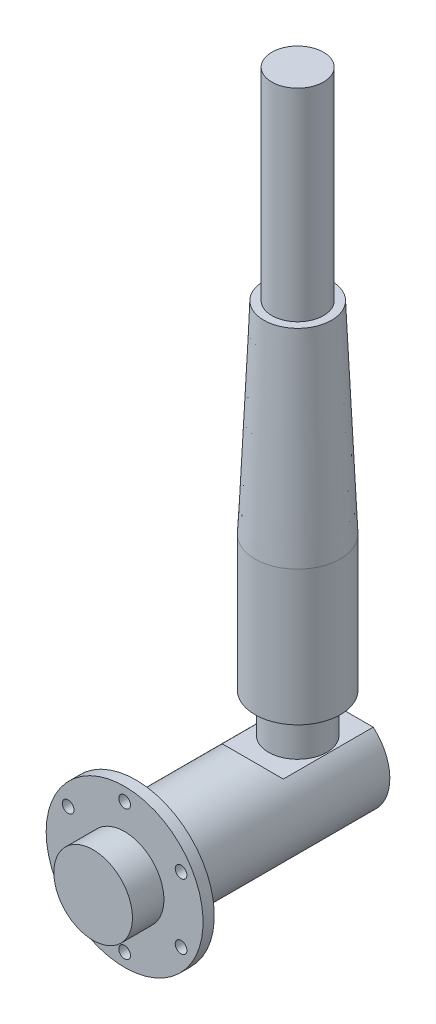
ISO-10303-21;
HEADER;
FILE_DESCRIPTION(('STEP AP214'),'2;1');
FILE_NAME('part.step','',(''),(''),'','','');
FILE_SCHEMA(('AUTOMOTIVE_DESIGN { 1 0 10303 214 1 1 1 1 }'));
ENDSEC;
DATA;
#1=APPLICATION_CONTEXT('core data for automotive mechanical design processes');
#2=APPLICATION_PROTOCOL_DEFINITION('international standard','automotive_design',2000,#1);
#3=PRODUCT_CONTEXT('',#1,'mechanical');
#4=PRODUCT('Part','Part','',(#3));
#5=PRODUCT_RELATED_PRODUCT_CATEGORY('part','',(#4));
#6=PRODUCT_DEFINITION_FORMATION('','',#4);
#7=PRODUCT_DEFINITION_CONTEXT('part definition',#1,'design');
#8=PRODUCT_DEFINITION('design','',#6,#7);
#9=PRODUCT_DEFINITION_SHAPE('','',#8);
#10=(LENGTH_UNIT() NAMED_UNIT(*) SI_UNIT(.MILLI.,.METRE.));
#11=(NAMED_UNIT(*) PLANE_ANGLE_UNIT() SI_UNIT($,.RADIAN.));
#12=(NAMED_UNIT(*) SI_UNIT($,.STERADIAN.) SOLID_ANGLE_UNIT());
#13=UNCERTAINTY_MEASURE_WITH_UNIT(LENGTH_MEASURE(1.E-05),#10,'distance_accuracy_value','');
#14=(GEOMETRIC_REPRESENTATION_CONTEXT(3) GLOBAL_UNCERTAINTY_ASSIGNED_CONTEXT((#13)) GLOBAL_UNIT_ASSIGNED_CONTEXT((#10,
#11,#12)) REPRESENTATION_CONTEXT('',''));
#15=CARTESIAN_POINT('',(0.,0.,0.));
#16=DIRECTION('',(0.,0.,1.));
#17=DIRECTION('',(1.,0.,0.));
#18=AXIS2_PLACEMENT_3D('',#15,#16,#17);
#19=CARTESIAN_POINT('',(0.,233.045,-97.79));
#20=DIRECTION('',(0.,1.,0.));
#21=DIRECTION('',(0.,0.,1.));
#22=AXIS2_PLACEMENT_3D('',#19,#20,#21);
#23=PLANE('',#22);
#24=CARTESIAN_POINT('',(0.,233.045,-97.79));
#25=DIRECTION('',(0.,1.,0.));
#26=DIRECTION('',(0.,0.,1.));
#27=AXIS2_PLACEMENT_3D('',#24,#25,#26);
#28=CIRCLE('',#27,19.13955422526);
#29=CARTESIAN_POINT('',(0.,233.045,-78.65044577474));
#30=VERTEX_POINT('',#29);
#31=EDGE_CURVE('E457',#30,#30,#28,.T.);
#32=ORIENTED_EDGE('',*,*,#31,.T.);
#33=EDGE_LOOP('',(#32));
#34=FACE_BOUND('',#33,.T.);
#35=CARTESIAN_POINT('',(0.,233.045,-97.79));
#36=DIRECTION('',(0.,1.,0.));
#37=DIRECTION('',(0.,0.,1.));
#38=AXIS2_PLACEMENT_3D('',#35,#36,#37);
#39=CIRCLE('',#38,14.605);
#40=CARTESIAN_POINT('',(0.,233.045,-83.185));
#41=VERTEX_POINT('',#40);
#42=EDGE_CURVE('E463',#41,#41,#39,.T.);
#43=ORIENTED_EDGE('',*,*,#42,.F.);
#44=EDGE_LOOP('',(#43));
#45=FACE_BOUND('',#44,.T.);
#46=ADVANCED_FACE('F383',(#34,#45),#23,.T.);
#47=CARTESIAN_POINT('',(0.,0.,-123.19));
#48=DIRECTION('',(0.,0.,-1.));
#49=DIRECTION('',(-1.,0.,0.));
#50=AXIS2_PLACEMENT_3D('',#47,#48,#49);
#51=PLANE('',#50);
#52=DIRECTION('',(1.,0.,0.));
#53=VECTOR('',#52,1.);
#54=CARTESIAN_POINT('',(-44.323,20.32,-123.19));
#55=LINE('',#54,#53);
#56=CARTESIAN_POINT('',(-17.273867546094,20.32,-123.19));
#57=VERTEX_POINT('',#56);
#58=CARTESIAN_POINT('',(17.273867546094,20.32,-123.19));
#59=VERTEX_POINT('',#58);
#60=EDGE_CURVE('E415',#57,#59,#55,.T.);
#61=ORIENTED_EDGE('',*,*,#60,.T.);
#62=CARTESIAN_POINT('',(0.,0.,-123.19));
#63=DIRECTION('',(0.,0.,-1.));
#64=DIRECTION('',(-1.,0.,0.));
#65=AXIS2_PLACEMENT_3D('',#62,#63,#64);
#66=CIRCLE('',#65,26.67);
#67=EDGE_CURVE('E412',#59,#57,#66,.T.);
#68=ORIENTED_EDGE('',*,*,#67,.T.);
#69=EDGE_LOOP('',(#61,#68));
#70=FACE_BOUND('',#69,.T.);
#71=ADVANCED_FACE('F385',(#70),#51,.T.);
#72=CARTESIAN_POINT('',(0.,0.,-163.063601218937));
#73=DIRECTION('',(0.,0.,-1.));
#74=DIRECTION('',(-1.,0.,0.));
#75=AXIS2_PLACEMENT_3D('',#72,#73,#74);
#76=CYLINDRICAL_SURFACE('',#75,26.67);
#77=DIRECTION('',(0.,0.,-1.));
#78=VECTOR('',#77,1.);
#79=CARTESIAN_POINT('',(-17.273867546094,20.32,-163.063601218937));
#80=LINE('',#79,#78);
#81=CARTESIAN_POINT('',(-17.273867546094,20.32,-72.39));
#82=VERTEX_POINT('',#81);
#83=EDGE_CURVE('E11',#57,#82,#80,.F.);
#84=ORIENTED_EDGE('',*,*,#83,.F.);
#85=ORIENTED_EDGE('',*,*,#67,.F.);
#86=DIRECTION('',(0.,0.,-1.));
#87=VECTOR('',#86,1.);
#88=CARTESIAN_POINT('',(17.273867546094,20.32,-163.063601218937));
#89=LINE('',#88,#87);
#90=CARTESIAN_POINT('',(17.273867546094,20.32,-72.39));
#91=VERTEX_POINT('',#90);
#92=EDGE_CURVE('E391',#91,#59,#89,.T.);
#93=ORIENTED_EDGE('',*,*,#92,.F.);
#94=CARTESIAN_POINT('',(0.,0.,-92.7100000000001));
#95=DIRECTION('',(0.,-0.707106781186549,0.707106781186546));
#96=DIRECTION('',(0.,-0.707106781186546,-0.707106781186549));
#97=AXIS2_PLACEMENT_3D('',#94,#95,#96);
#98=ELLIPSE('',#97,37.7170757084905,26.67);
#99=EDGE_CURVE('E408',#82,#91,#98,.F.);
#100=ORIENTED_EDGE('',*,*,#99,.F.);
#101=EDGE_LOOP('',(#84,#85,#93,#100));
#102=FACE_BOUND('',#101,.T.);
#103=CARTESIAN_POINT('',(0.,0.,-6.34999999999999));
#104=DIRECTION('',(0.,0.,-1.));
#105=DIRECTION('',(-1.,0.,0.));
#106=AXIS2_PLACEMENT_3D('',#103,#104,#105);
#107=CIRCLE('',#106,26.67);
#108=CARTESIAN_POINT('',(-26.67,0.,-6.34999999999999));
#109=VERTEX_POINT('',#108);
#110=EDGE_CURVE('E424',#109,#109,#107,.T.);
#111=ORIENTED_EDGE('',*,*,#110,.T.);
#112=EDGE_LOOP('',(#111));
#113=FACE_BOUND('',#112,.T.);
#114=ADVANCED_FACE('F419',(#102,#113),#76,.T.);
#115=CARTESIAN_POINT('',(-44.323,0.,-6.35));
#116=DIRECTION('',(0.,0.,-1.));
#117=DIRECTION('',(-1.,0.,0.));
#118=AXIS2_PLACEMENT_3D('',#115,#116,#117);
#119=PLANE('',#118);
#120=CARTESIAN_POINT('',(31.8957156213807,18.4150000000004,-6.34999999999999));
#121=DIRECTION('',(0.,0.,-1.));
#122=DIRECTION('',(-0.50000000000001,0.866025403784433,0.));
#123=AXIS2_PLACEMENT_3D('',#120,#121,#122);
#124=CIRCLE('',#123,3.302);
#125=CARTESIAN_POINT('',(30.2447156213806,21.2746158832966,-6.34999999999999));
#126=VERTEX_POINT('',#125);
#127=EDGE_CURVE('E499',#126,#126,#124,.F.);
#128=ORIENTED_EDGE('',*,*,#127,.T.);
#129=EDGE_LOOP('',(#128));
#130=FACE_BOUND('',#129,.T.);
#131=CARTESIAN_POINT('',(31.895715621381,-18.4149999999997,-6.34999999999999));
#132=DIRECTION('',(0.,0.,-1.));
#133=DIRECTION('',(0.499999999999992,0.866025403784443,0.));
#134=AXIS2_PLACEMENT_3D('',#131,#132,#133);
#135=CIRCLE('',#134,3.302);
#136=CARTESIAN_POINT('',(33.546715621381,-15.5553841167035,-6.34999999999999));
#137=VERTEX_POINT('',#136);
#138=EDGE_CURVE('E493',#137,#137,#135,.F.);
#139=ORIENTED_EDGE('',*,*,#138,.T.);
#140=EDGE_LOOP('',(#139));
#141=FACE_BOUND('',#140,.T.);
#142=CARTESIAN_POINT('',(2.57182664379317E-13,-36.83,-6.34999999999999));
#143=DIRECTION('',(0.,0.,-1.));
#144=DIRECTION('',(1.,0.,0.));
#145=AXIS2_PLACEMENT_3D('',#142,#143,#144);
#146=CIRCLE('',#145,3.302);
#147=CARTESIAN_POINT('',(3.30200000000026,-36.83,-6.34999999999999));
#148=VERTEX_POINT('',#147);
#149=EDGE_CURVE('E487',#148,#148,#146,.F.);
#150=ORIENTED_EDGE('',*,*,#149,.T.);
#151=EDGE_LOOP('',(#150));
#152=FACE_BOUND('',#151,.T.);
#153=CARTESIAN_POINT('',(-31.8957156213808,-18.4150000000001,-6.34999999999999));
#154=DIRECTION('',(0.,0.,-1.));
#155=DIRECTION('',(0.500000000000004,-0.866025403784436,0.));
#156=AXIS2_PLACEMENT_3D('',#153,#154,#155);
#157=CIRCLE('',#156,3.302);
#158=CARTESIAN_POINT('',(-30.2447156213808,-21.2746158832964,-6.34999999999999));
#159=VERTEX_POINT('',#158);
#160=EDGE_CURVE('E481',#159,#159,#157,.F.);
#161=ORIENTED_EDGE('',*,*,#160,.T.);
#162=EDGE_LOOP('',(#161));
#163=FACE_BOUND('',#162,.T.);
#164=CARTESIAN_POINT('',(-31.8957156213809,18.4149999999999,-6.34999999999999));
#165=DIRECTION('',(0.,0.,-1.));
#166=DIRECTION('',(-0.499999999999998,-0.86602540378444,0.));
#167=AXIS2_PLACEMENT_3D('',#164,#165,#166);
#168=CIRCLE('',#167,3.302);
#169=CARTESIAN_POINT('',(-33.5467156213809,15.5553841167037,-6.34999999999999));
#170=VERTEX_POINT('',#169);
#171=EDGE_CURVE('E475',#170,#170,#168,.F.);
#172=ORIENTED_EDGE('',*,*,#171,.T.);
#173=EDGE_LOOP('',(#172));
#174=FACE_BOUND('',#173,.T.);
#175=CARTESIAN_POINT('',(0.,36.83,-6.34999999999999));
#176=DIRECTION('',(0.,0.,-1.));
#177=DIRECTION('',(-1.,0.,0.));
#178=AXIS2_PLACEMENT_3D('',#175,#176,#177);
#179=CIRCLE('',#178,3.302);
#180=CARTESIAN_POINT('',(-3.302,36.83,-6.34999999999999));
#181=VERTEX_POINT('',#180);
#182=EDGE_CURVE('E469',#181,#181,#179,.F.);
#183=ORIENTED_EDGE('',*,*,#182,.T.);
#184=EDGE_LOOP('',(#183));
#185=FACE_BOUND('',#184,.T.);
#186=CARTESIAN_POINT('',(0.,0.,-6.34999999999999));
#187=DIRECTION('',(0.,0.,-1.));
#188=DIRECTION('',(-1.,0.,0.));
#189=AXIS2_PLACEMENT_3D('',#186,#187,#188);
#190=CIRCLE('',#189,44.323);
#191=CARTESIAN_POINT('',(-44.323,0.,-6.34999999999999));
#192=VERTEX_POINT('',#191);
#193=EDGE_CURVE('E427',#192,#192,#190,.T.);
#194=ORIENTED_EDGE('',*,*,#193,.T.);
#195=EDGE_LOOP('',(#194));
#196=FACE_BOUND('',#195,.T.);
#197=ORIENTED_EDGE('',*,*,#110,.F.);
#198=EDGE_LOOP('',(#197));
#199=FACE_BOUND('',#198,.T.);
#200=ADVANCED_FACE('F503',(#130,#141,#152,#163,#174,#185,#196,#199),#119,.T.);
#201=CARTESIAN_POINT('',(0.,0.,-163.063601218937));
#202=DIRECTION('',(0.,0.,-1.));
#203=DIRECTION('',(-1.,0.,0.));
#204=AXIS2_PLACEMENT_3D('',#201,#202,#203);
#205=CYLINDRICAL_SURFACE('',#204,44.323);
#206=CARTESIAN_POINT('',(0.,0.,0.));
#207=DIRECTION('',(0.,0.,-1.));
#208=DIRECTION('',(-1.,0.,0.));
#209=AXIS2_PLACEMENT_3D('',#206,#207,#208);
#210=CIRCLE('',#209,44.323);
#211=CARTESIAN_POINT('',(-44.323,0.,0.));
#212=VERTEX_POINT('',#211);
#213=EDGE_CURVE('E430',#212,#212,#210,.T.);
#214=ORIENTED_EDGE('',*,*,#213,.T.);
#215=EDGE_LOOP('',(#214));
#216=FACE_BOUND('',#215,.T.);
#217=ORIENTED_EDGE('',*,*,#193,.F.);
#218=EDGE_LOOP('',(#217));
#219=FACE_BOUND('',#218,.T.);
#220=ADVANCED_FACE('F517',(#216,#219),#205,.T.);
#221=CARTESIAN_POINT('',(-22.1996,0.,0.));
#222=DIRECTION('',(0.,0.,1.));
#223=DIRECTION('',(1.,0.,0.));
#224=AXIS2_PLACEMENT_3D('',#221,#222,#223);
#225=PLANE('',#224);
#226=CARTESIAN_POINT('',(31.8957156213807,18.4150000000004,0.));
#227=DIRECTION('',(0.,0.,1.));
#228=DIRECTION('',(0.50000000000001,-0.866025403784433,0.));
#229=AXIS2_PLACEMENT_3D('',#226,#227,#228);
#230=CIRCLE('',#229,3.302);
#231=CARTESIAN_POINT('',(33.5467156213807,15.5553841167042,0.));
#232=VERTEX_POINT('',#231);
#233=EDGE_CURVE('E496',#232,#232,#230,.T.);
#234=ORIENTED_EDGE('',*,*,#233,.F.);
#235=EDGE_LOOP('',(#234));
#236=FACE_BOUND('',#235,.T.);
#237=CARTESIAN_POINT('',(31.895715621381,-18.4149999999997,0.));
#238=DIRECTION('',(0.,0.,1.));
#239=DIRECTION('',(-0.499999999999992,-0.866025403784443,0.));
#240=AXIS2_PLACEMENT_3D('',#237,#238,#239);
#241=CIRCLE('',#240,3.302);
#242=CARTESIAN_POINT('',(30.2447156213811,-21.2746158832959,0.));
#243=VERTEX_POINT('',#242);
#244=EDGE_CURVE('E490',#243,#243,#241,.T.);
#245=ORIENTED_EDGE('',*,*,#244,.F.);
#246=EDGE_LOOP('',(#245));
#247=FACE_BOUND('',#246,.T.);
#248=CARTESIAN_POINT('',(2.57182664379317E-13,-36.83,0.));
#249=DIRECTION('',(0.,0.,1.));
#250=DIRECTION('',(-1.,0.,0.));
#251=AXIS2_PLACEMENT_3D('',#248,#249,#250);
#252=CIRCLE('',#251,3.302);
#253=CARTESIAN_POINT('',(-3.30199999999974,-36.83,0.));
#254=VERTEX_POINT('',#253);
#255=EDGE_CURVE('E484',#254,#254,#252,.T.);
#256=ORIENTED_EDGE('',*,*,#255,.F.);
#257=EDGE_LOOP('',(#256));
#258=FACE_BOUND('',#257,.T.);
#259=CARTESIAN_POINT('',(-31.8957156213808,-18.4150000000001,0.));
#260=DIRECTION('',(0.,0.,1.));
#261=DIRECTION('',(-0.500000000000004,0.866025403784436,0.));
#262=AXIS2_PLACEMENT_3D('',#259,#260,#261);
#263=CIRCLE('',#262,3.302);
#264=CARTESIAN_POINT('',(-33.5467156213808,-15.5553841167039,0.));
#265=VERTEX_POINT('',#264);
#266=EDGE_CURVE('E478',#265,#265,#263,.T.);
#267=ORIENTED_EDGE('',*,*,#266,.F.);
#268=EDGE_LOOP('',(#267));
#269=FACE_BOUND('',#268,.T.);
#270=CARTESIAN_POINT('',(-31.8957156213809,18.4149999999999,0.));
#271=DIRECTION('',(0.,0.,1.));
#272=DIRECTION('',(0.499999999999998,0.86602540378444,0.));
#273=AXIS2_PLACEMENT_3D('',#270,#271,#272);
#274=CIRCLE('',#273,3.302);
#275=CARTESIAN_POINT('',(-30.2447156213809,21.2746158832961,0.));
#276=VERTEX_POINT('',#275);
#277=EDGE_CURVE('E472',#276,#276,#274,.T.);
#278=ORIENTED_EDGE('',*,*,#277,.F.);
#279=EDGE_LOOP('',(#278));
#280=FACE_BOUND('',#279,.T.);
#281=CARTESIAN_POINT('',(0.,36.83,0.));
#282=DIRECTION('',(0.,0.,1.));
#283=DIRECTION('',(1.,0.,0.));
#284=AXIS2_PLACEMENT_3D('',#281,#282,#283);
#285=CIRCLE('',#284,3.302);
#286=CARTESIAN_POINT('',(3.302,36.83,0.));
#287=VERTEX_POINT('',#286);
#288=EDGE_CURVE('E466',#287,#287,#285,.T.);
#289=ORIENTED_EDGE('',*,*,#288,.F.);
#290=EDGE_LOOP('',(#289));
#291=FACE_BOUND('',#290,.T.);
#292=CARTESIAN_POINT('',(0.,0.,0.));
#293=DIRECTION('',(0.,0.,-1.));
#294=DIRECTION('',(-1.,0.,0.));
#295=AXIS2_PLACEMENT_3D('',#292,#293,#294);
#296=CIRCLE('',#295,22.1996);
#297=CARTESIAN_POINT('',(-22.1996,0.,0.));
#298=VERTEX_POINT('',#297);
#299=EDGE_CURVE('E433',#298,#298,#296,.T.);
#300=ORIENTED_EDGE('',*,*,#299,.T.);
#301=EDGE_LOOP('',(#300));
#302=FACE_BOUND('',#301,.T.);
#303=ORIENTED_EDGE('',*,*,#213,.F.);
#304=EDGE_LOOP('',(#303));
#305=FACE_BOUND('',#304,.T.);
#306=ADVANCED_FACE('F513',(#236,#247,#258,#269,#280,#291,#302,#305),#225,.T.);
#307=CARTESIAN_POINT('',(0.,0.,-163.063601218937));
#308=DIRECTION('',(0.,0.,-1.));
#309=DIRECTION('',(-1.,0.,0.));
#310=AXIS2_PLACEMENT_3D('',#307,#308,#309);
#311=CYLINDRICAL_SURFACE('',#310,22.1996);
#312=CARTESIAN_POINT('',(0.,0.,17.78));
#313=DIRECTION('',(0.,0.,-1.));
#314=DIRECTION('',(-1.,0.,0.));
#315=AXIS2_PLACEMENT_3D('',#312,#313,#314);
#316=CIRCLE('',#315,22.1996);
#317=CARTESIAN_POINT('',(-22.1996,0.,17.78));
#318=VERTEX_POINT('',#317);
#319=EDGE_CURVE('E436',#318,#318,#316,.T.);
#320=ORIENTED_EDGE('',*,*,#319,.T.);
#321=EDGE_LOOP('',(#320));
#322=FACE_BOUND('',#321,.T.);
#323=ORIENTED_EDGE('',*,*,#299,.F.);
#324=EDGE_LOOP('',(#323));
#325=FACE_BOUND('',#324,.T.);
#326=ADVANCED_FACE('F516',(#322,#325),#311,.T.);
#327=CARTESIAN_POINT('',(0.,0.,17.78));
#328=DIRECTION('',(0.,0.,1.));
#329=DIRECTION('',(1.,0.,0.));
#330=AXIS2_PLACEMENT_3D('',#327,#328,#329);
#331=PLANE('',#330);
#332=ORIENTED_EDGE('',*,*,#319,.F.);
#333=EDGE_LOOP('',(#332));
#334=FACE_BOUND('',#333,.T.);
#335=ADVANCED_FACE('F585',(#334),#331,.T.);
#336=CARTESIAN_POINT('',(-44.323,20.32,-72.39));
#337=DIRECTION('',(0.,-1.,0.));
#338=DIRECTION('',(0.,0.,-1.));
#339=AXIS2_PLACEMENT_3D('',#336,#337,#338);
#340=PLANE('',#339);
#341=CARTESIAN_POINT('',(0.,20.32,-97.79));
#342=DIRECTION('',(0.,1.,0.));
#343=DIRECTION('',(0.,0.,1.));
#344=AXIS2_PLACEMENT_3D('',#341,#342,#343);
#345=CIRCLE('',#344,16.51);
#346=CARTESIAN_POINT('',(0.,20.32,-81.28));
#347=VERTEX_POINT('',#346);
#348=EDGE_CURVE('E416',#347,#347,#345,.T.);
#349=ORIENTED_EDGE('',*,*,#348,.F.);
#350=EDGE_LOOP('',(#349));
#351=FACE_BOUND('',#350,.T.);
#352=ORIENTED_EDGE('',*,*,#83,.T.);
#353=DIRECTION('',(1.,0.,0.));
#354=VECTOR('',#353,1.);
#355=CARTESIAN_POINT('',(-44.323,20.32,-72.39));
#356=LINE('',#355,#354);
#357=EDGE_CURVE('E397',#82,#91,#356,.T.);
#358=ORIENTED_EDGE('',*,*,#357,.T.);
#359=ORIENTED_EDGE('',*,*,#92,.T.);
#360=ORIENTED_EDGE('',*,*,#60,.F.);
#361=EDGE_LOOP('',(#352,#358,#359,#360));
#362=FACE_BOUND('',#361,.T.);
#363=ADVANCED_FACE('F414',(#351,#362),#340,.F.);
#364=CARTESIAN_POINT('',(-44.323,28.6734719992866,-64.0365280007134));
#365=DIRECTION('',(0.,-0.707106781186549,0.707106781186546));
#366=DIRECTION('',(0.,-0.707106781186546,-0.707106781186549));
#367=AXIS2_PLACEMENT_3D('',#364,#365,#366);
#368=PLANE('',#367);
#369=ORIENTED_EDGE('',*,*,#99,.T.);
#370=ORIENTED_EDGE('',*,*,#357,.F.);
#371=EDGE_LOOP('',(#369,#370));
#372=FACE_BOUND('',#371,.T.);
#373=ADVANCED_FACE('F409',(#372),#368,.F.);
#374=CARTESIAN_POINT('',(0.,249.603740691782,-97.79));
#375=DIRECTION('',(0.,1.,0.));
#376=DIRECTION('',(0.,0.,1.));
#377=AXIS2_PLACEMENT_3D('',#374,#375,#376);
#378=CYLINDRICAL_SURFACE('',#377,16.51);
#379=ORIENTED_EDGE('',*,*,#348,.T.);
#380=EDGE_LOOP('',(#379));
#381=FACE_BOUND('',#380,.T.);
#382=CARTESIAN_POINT('',(0.,39.37,-97.79));
#383=DIRECTION('',(0.,1.,0.));
#384=DIRECTION('',(0.,0.,1.));
#385=AXIS2_PLACEMENT_3D('',#382,#383,#384);
#386=CIRCLE('',#385,16.51);
#387=CARTESIAN_POINT('',(0.,39.37,-81.28));
#388=VERTEX_POINT('',#387);
#389=EDGE_CURVE('E442',#388,#388,#386,.T.);
#390=ORIENTED_EDGE('',*,*,#389,.F.);
#391=EDGE_LOOP('',(#390));
#392=FACE_BOUND('',#391,.T.);
#393=ADVANCED_FACE('F578',(#381,#392),#378,.T.);
#394=CARTESIAN_POINT('',(0.,39.37,-81.28));
#395=DIRECTION('',(0.,-1.,0.));
#396=DIRECTION('',(0.,0.,-1.));
#397=AXIS2_PLACEMENT_3D('',#394,#395,#396);
#398=PLANE('',#397);
#399=ORIENTED_EDGE('',*,*,#389,.T.);
#400=EDGE_LOOP('',(#399));
#401=FACE_BOUND('',#400,.T.);
#402=CARTESIAN_POINT('',(0.,39.37,-97.79));
#403=DIRECTION('',(0.,1.,0.));
#404=DIRECTION('',(0.,0.,1.));
#405=AXIS2_PLACEMENT_3D('',#402,#403,#404);
#406=CIRCLE('',#405,17.4625);
#407=CARTESIAN_POINT('',(0.,39.37,-80.3275));
#408=VERTEX_POINT('',#407);
#409=EDGE_CURVE('E445',#408,#408,#406,.T.);
#410=ORIENTED_EDGE('',*,*,#409,.F.);
#411=EDGE_LOOP('',(#410));
#412=FACE_BOUND('',#411,.T.);
#413=ADVANCED_FACE('F574',(#401,#412),#398,.T.);
#414=CARTESIAN_POINT('',(0.,249.603740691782,-97.79));
#415=DIRECTION('',(0.,1.,0.));
#416=DIRECTION('',(0.,0.,1.));
#417=AXIS2_PLACEMENT_3D('',#414,#415,#416);
#418=CYLINDRICAL_SURFACE('',#417,17.4625);
#419=ORIENTED_EDGE('',*,*,#409,.T.);
#420=EDGE_LOOP('',(#419));
#421=FACE_BOUND('',#420,.T.);
#422=CARTESIAN_POINT('',(0.,42.545,-97.79));
#423=DIRECTION('',(0.,1.,0.));
#424=DIRECTION('',(0.,0.,1.));
#425=AXIS2_PLACEMENT_3D('',#422,#423,#424);
#426=CIRCLE('',#425,17.4625);
#427=CARTESIAN_POINT('',(0.,42.545,-80.3275));
#428=VERTEX_POINT('',#427);
#429=EDGE_CURVE('E448',#428,#428,#426,.T.);
#430=ORIENTED_EDGE('',*,*,#429,.F.);
#431=EDGE_LOOP('',(#430));
#432=FACE_BOUND('',#431,.T.);
#433=ADVANCED_FACE('F570',(#421,#432),#418,.T.);
#434=CARTESIAN_POINT('',(0.,42.545,-80.3275));
#435=DIRECTION('',(0.,-1.,0.));
#436=DIRECTION('',(0.,0.,-1.));
#437=AXIS2_PLACEMENT_3D('',#434,#435,#436);
#438=PLANE('',#437);
#439=ORIENTED_EDGE('',*,*,#429,.T.);
#440=EDGE_LOOP('',(#439));
#441=FACE_BOUND('',#440,.T.);
#442=CARTESIAN_POINT('',(0.,42.545,-97.79));
#443=DIRECTION('',(0.,1.,0.));
#444=DIRECTION('',(0.,0.,1.));
#445=AXIS2_PLACEMENT_3D('',#442,#443,#444);
#446=CIRCLE('',#445,24.13);
#447=CARTESIAN_POINT('',(0.,42.545,-73.66));
#448=VERTEX_POINT('',#447);
#449=EDGE_CURVE('E451',#448,#448,#446,.T.);
#450=ORIENTED_EDGE('',*,*,#449,.F.);
#451=EDGE_LOOP('',(#450));
#452=FACE_BOUND('',#451,.T.);
#453=ADVANCED_FACE('F566',(#441,#452),#438,.T.);
#454=CARTESIAN_POINT('',(0.,249.603740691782,-97.79));
#455=DIRECTION('',(0.,1.,0.));
#456=DIRECTION('',(0.,0.,1.));
#457=AXIS2_PLACEMENT_3D('',#454,#455,#456);
#458=CYLINDRICAL_SURFACE('',#457,24.13);
#459=ORIENTED_EDGE('',*,*,#449,.T.);
#460=EDGE_LOOP('',(#459));
#461=FACE_BOUND('',#460,.T.);
#462=CARTESIAN_POINT('',(0.,118.745,-97.79));
#463=DIRECTION('',(0.,1.,0.));
#464=DIRECTION('',(0.,0.,1.));
#465=AXIS2_PLACEMENT_3D('',#462,#463,#464);
#466=CIRCLE('',#465,24.13);
#467=CARTESIAN_POINT('',(0.,118.745,-73.66));
#468=VERTEX_POINT('',#467);
#469=EDGE_CURVE('E454',#468,#468,#466,.T.);
#470=ORIENTED_EDGE('',*,*,#469,.F.);
#471=EDGE_LOOP('',(#470));
#472=FACE_BOUND('',#471,.T.);
#473=ADVANCED_FACE('F562',(#461,#472),#458,.T.);
#474=CARTESIAN_POINT('',(0.,233.045,-97.79));
#475=DIRECTION('',(0.,-1.,0.));
#476=DIRECTION('',(0.,0.,-1.));
#477=AXIS2_PLACEMENT_3D('',#474,#475,#476);
#478=CONICAL_SURFACE('',#477,19.13955422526,0.0436332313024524);
#479=ORIENTED_EDGE('',*,*,#469,.T.);
#480=EDGE_LOOP('',(#479));
#481=FACE_BOUND('',#480,.T.);
#482=ORIENTED_EDGE('',*,*,#31,.F.);
#483=EDGE_LOOP('',(#482));
#484=FACE_BOUND('',#483,.T.);
#485=ADVANCED_FACE('F560',(#481,#484),#478,.T.);
#486=CARTESIAN_POINT('',(0.,347.345,-97.79));
#487=DIRECTION('',(0.,-1.,0.));
#488=DIRECTION('',(0.,0.,-1.));
#489=AXIS2_PLACEMENT_3D('',#486,#487,#488);
#490=CYLINDRICAL_SURFACE('',#489,14.605);
#491=CARTESIAN_POINT('',(0.,347.345,-97.79));
#492=DIRECTION('',(0.,1.,0.));
#493=DIRECTION('',(0.,0.,1.));
#494=AXIS2_PLACEMENT_3D('',#491,#492,#493);
#495=CIRCLE('',#494,14.605);
#496=CARTESIAN_POINT('',(0.,347.345,-83.185));
#497=VERTEX_POINT('',#496);
#498=EDGE_CURVE('E460',#497,#497,#495,.T.);
#499=ORIENTED_EDGE('',*,*,#498,.F.);
#500=EDGE_LOOP('',(#499));
#501=FACE_BOUND('',#500,.T.);
#502=ORIENTED_EDGE('',*,*,#42,.T.);
#503=EDGE_LOOP('',(#502));
#504=FACE_BOUND('',#503,.T.);
#505=ADVANCED_FACE('F558',(#501,#504),#490,.T.);
#506=CARTESIAN_POINT('',(0.,347.345,-97.79));
#507=DIRECTION('',(0.,1.,0.));
#508=DIRECTION('',(0.,0.,1.));
#509=AXIS2_PLACEMENT_3D('',#506,#507,#508);
#510=PLANE('',#509);
#511=ORIENTED_EDGE('',*,*,#498,.T.);
#512=EDGE_LOOP('',(#511));
#513=FACE_BOUND('',#512,.T.);
#514=ADVANCED_FACE('F663',(#513),#510,.T.);
#515=CARTESIAN_POINT('',(0.,36.83,-123.191));
#516=DIRECTION('',(0.,0.,1.));
#517=DIRECTION('',(1.,0.,0.));
#518=AXIS2_PLACEMENT_3D('',#515,#516,#517);
#519=CYLINDRICAL_SURFACE('',#518,3.302);
#520=ORIENTED_EDGE('',*,*,#182,.F.);
#521=EDGE_LOOP('',(#520));
#522=FACE_BOUND('',#521,.T.);
#523=ORIENTED_EDGE('',*,*,#288,.T.);
#524=EDGE_LOOP('',(#523));
#525=FACE_BOUND('',#524,.T.);
#526=ADVANCED_FACE('F629',(#522,#525),#519,.F.);
#527=CARTESIAN_POINT('',(-31.8957156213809,18.4149999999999,-123.191));
#528=DIRECTION('',(0.,0.,1.));
#529=DIRECTION('',(0.499999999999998,0.86602540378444,0.));
#530=AXIS2_PLACEMENT_3D('',#527,#528,#529);
#531=CYLINDRICAL_SURFACE('',#530,3.302);
#532=ORIENTED_EDGE('',*,*,#171,.F.);
#533=EDGE_LOOP('',(#532));
#534=FACE_BOUND('',#533,.T.);
#535=ORIENTED_EDGE('',*,*,#277,.T.);
#536=EDGE_LOOP('',(#535));
#537=FACE_BOUND('',#536,.T.);
#538=ADVANCED_FACE('F624',(#534,#537),#531,.F.);
#539=CARTESIAN_POINT('',(-31.8957156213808,-18.4150000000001,-123.191));
#540=DIRECTION('',(0.,0.,1.));
#541=DIRECTION('',(-0.500000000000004,0.866025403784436,0.));
#542=AXIS2_PLACEMENT_3D('',#539,#540,#541);
#543=CYLINDRICAL_SURFACE('',#542,3.302);
#544=ORIENTED_EDGE('',*,*,#160,.F.);
#545=EDGE_LOOP('',(#544));
#546=FACE_BOUND('',#545,.T.);
#547=ORIENTED_EDGE('',*,*,#266,.T.);
#548=EDGE_LOOP('',(#547));
#549=FACE_BOUND('',#548,.T.);
#550=ADVANCED_FACE('F628',(#546,#549),#543,.F.);
#551=CARTESIAN_POINT('',(2.57182664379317E-13,-36.83,-123.191));
#552=DIRECTION('',(0.,0.,1.));
#553=DIRECTION('',(-1.,0.,0.));
#554=AXIS2_PLACEMENT_3D('',#551,#552,#553);
#555=CYLINDRICAL_SURFACE('',#554,3.302);
#556=ORIENTED_EDGE('',*,*,#149,.F.);
#557=EDGE_LOOP('',(#556));
#558=FACE_BOUND('',#557,.T.);
#559=ORIENTED_EDGE('',*,*,#255,.T.);
#560=EDGE_LOOP('',(#559));
#561=FACE_BOUND('',#560,.T.);
#562=ADVANCED_FACE('F638',(#558,#561),#555,.F.);
#563=CARTESIAN_POINT('',(31.895715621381,-18.4149999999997,-123.191));
#564=DIRECTION('',(0.,0.,1.));
#565=DIRECTION('',(-0.499999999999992,-0.866025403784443,0.));
#566=AXIS2_PLACEMENT_3D('',#563,#564,#565);
#567=CYLINDRICAL_SURFACE('',#566,3.302);
#568=ORIENTED_EDGE('',*,*,#138,.F.);
#569=EDGE_LOOP('',(#568));
#570=FACE_BOUND('',#569,.T.);
#571=ORIENTED_EDGE('',*,*,#244,.T.);
#572=EDGE_LOOP('',(#571));
#573=FACE_BOUND('',#572,.T.);
#574=ADVANCED_FACE('F509',(#570,#573),#567,.F.);
#575=CARTESIAN_POINT('',(31.8957156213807,18.4150000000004,-123.191));
#576=DIRECTION('',(0.,0.,1.));
#577=DIRECTION('',(0.50000000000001,-0.866025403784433,0.));
#578=AXIS2_PLACEMENT_3D('',#575,#576,#577);
#579=CYLINDRICAL_SURFACE('',#578,3.302);
#580=ORIENTED_EDGE('',*,*,#127,.F.);
#581=EDGE_LOOP('',(#580));
#582=FACE_BOUND('',#581,.T.);
#583=ORIENTED_EDGE('',*,*,#233,.T.);
#584=EDGE_LOOP('',(#583));
#585=FACE_BOUND('',#584,.T.);
#586=ADVANCED_FACE('F506',(#582,#585),#579,.F.);
#587=CLOSED_SHELL('',(#46,#71,#114,#200,#220,#306,#326,#335,#363,#373,#393,#413,#433,#453,#473,
#485,#505,#514,#526,#538,#550,#562,#574,#586));
#588=MANIFOLD_SOLID_BREP('B2',#587);
#589=ADVANCED_BREP_SHAPE_REPRESENTATION('',(#18,#588),#14);
#590=SHAPE_DEFINITION_REPRESENTATION(#9,#589);
ENDSEC;
END-ISO-10303-21;
